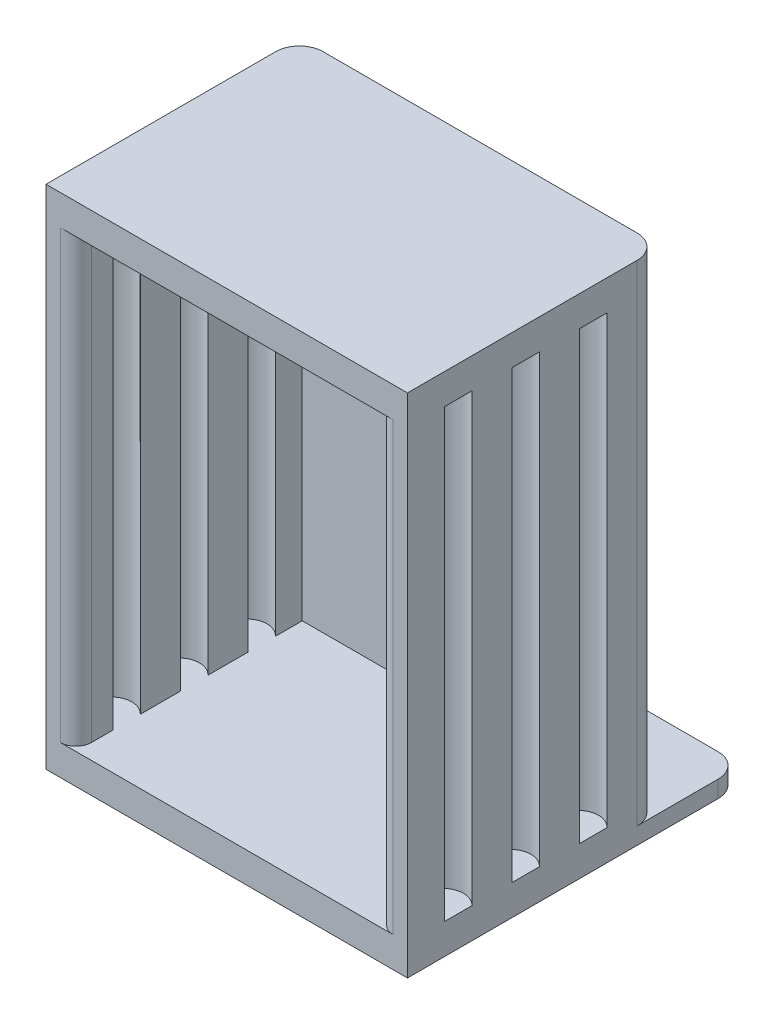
from build123d import *

# Parameters (mm, degrees)
SKETCH1_W          = 27.178
SKETCH1_H          = 19.05
EXTRUDE1_DEPTH     = 38.1
SKETCH2_W          = 22.6822
SKETCH2_H          = 33.528
CUT_EXTRUDE1_DEPTH = 17.018
SKETCH3_W          = 27.178
SKETCH3_H          = 6.096
EXTRUDE2_DEPTH     = 1.27
FILLET1_R          = 1.778
SKETCH4_R          = 1.524
CUT_EXTRUDE2_DEPTH = 16.764
FILLET2_R          = 1.778
FILLET3_R          = 1.1684


with BuildPart() as part:
    # Sketch1 → Extrude1 (new body)
    with BuildSketch(Plane(origin=(0, 0, 0), x_dir=(1, 0, 0), z_dir=(0, 1, 0))):
        with Locations((0, 9.525)):
            Rectangle(SKETCH1_W, SKETCH1_H)
    extrude(amount=EXTRUDE1_DEPTH)

    # Sketch2 → Cut-Extrude1 (cut)
    with BuildSketch(Plane.XY):
        with Locations((0, 19.05)):
            Rectangle(SKETCH2_W, SKETCH2_H)
    extrude(amount=-CUT_EXTRUDE1_DEPTH, mode=Mode.SUBTRACT)

    # Sketch3 → Extrude2 (add)
    with BuildSketch(Plane.XZ):
        with Locations((0, -22.098)):
            Rectangle(SKETCH3_W, SKETCH3_H)
    extrude(amount=-EXTRUDE2_DEPTH)

    # Fillet1
    fillet1_edges = [part.edges().sort_by_distance(p)[0] for p in [
        (-13.589, 19.685, -19.05),
        (13.589, 19.685, -19.05),
    ]]
    fillet(fillet1_edges, radius=FILLET1_R)

    # Sketch4 → Cut-Extrude2 (cut, symmetric)
    with BuildSketch(Plane(origin=(0, 19.05, 0), x_dir=(-1, 0, 0), z_dir=(0, 1, 0))):
        with Locations((-12.46505, -3.81)):
            Circle(SKETCH4_R)
        with Locations((-12.46505, -8.89)):
            Circle(SKETCH4_R)
        with Locations((-12.46505, -13.97)):
            Circle(SKETCH4_R)
    cut_extrude2 = extrude(amount=CUT_EXTRUDE2_DEPTH, both=True, mode=Mode.SUBTRACT)

    # Mirror1: Cut-Extrude2 across plane
    add(cut_extrude2.mirror(Plane(origin=(0, 0, 0), x_dir=(0, 0, 1), z_dir=(1, 0, 0))), mode=Mode.SUBTRACT)

    # Fillet2
    fillet2_edges = [part.edges().sort_by_distance(p)[0] for p in [
        (-13.589, 0.635, -25.146),
        (13.589, 0.635, -25.146),
    ]]
    fillet(fillet2_edges, radius=FILLET2_R)

    # Fillet3
    fillet3_edges = [part.edges().sort_by_distance(p)[0] for p in [
        (-11.3411, 19.05, 0),
        (11.3411, 19.05, 0),
    ]]
    fillet(fillet3_edges, radius=FILLET3_R)


solid = part.part
